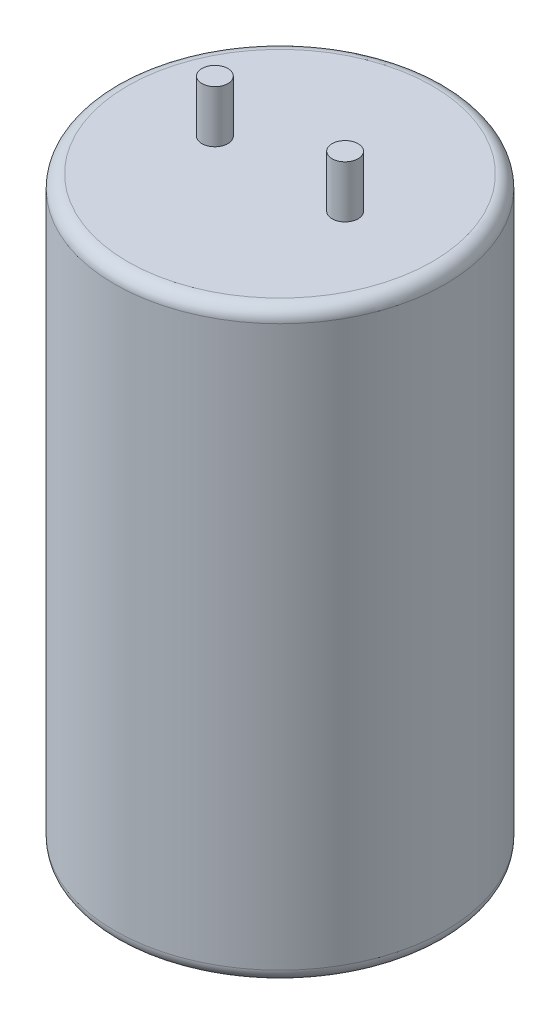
from build123d import *

# Parameters (mm, degrees)
ESBO_O1_R                = 12.7
RESSALTO_EXTRUS_O1_DEPTH = 45
FILETE1_R                = 1
ESBO_O2_R                = 1
RESSALTO_EXTRUS_O2_DEPTH = 4


with BuildPart() as part:
    # Esbo_o1 → Ressalto-extrus_o1 (new body)
    with BuildSketch(Plane(origin=(0, 0, 0), x_dir=(1, 0, 0), z_dir=(0, 1, 0))):
        with Locations(Location((0, 0, 0), (0, 0, 90))):
            Circle(ESBO_O1_R)
    extrude(amount=RESSALTO_EXTRUS_O1_DEPTH)

    # Filete1
    filete1_edges = [part.edges().sort_by_distance(p)[0] for p in [
        (0, 0, 12.7),
        (0, 45, 12.7),
    ]]
    fillet(filete1_edges, radius=FILETE1_R)

    # Esbo_o2 → Ressalto-extrus_o2 (add)
    with BuildSketch(Plane(origin=(0, 45, 0), x_dir=(1, 0, 0), z_dir=(0, 1, 0))):
        with Locations(Location((5, 0, 0), (0, 0, 270))):
            Circle(ESBO_O2_R)
        with Locations(Location((-5, 0, 0), (0, 0, 270))):
            Circle(ESBO_O2_R)
    extrude(amount=RESSALTO_EXTRUS_O2_DEPTH)


solid = part.part
